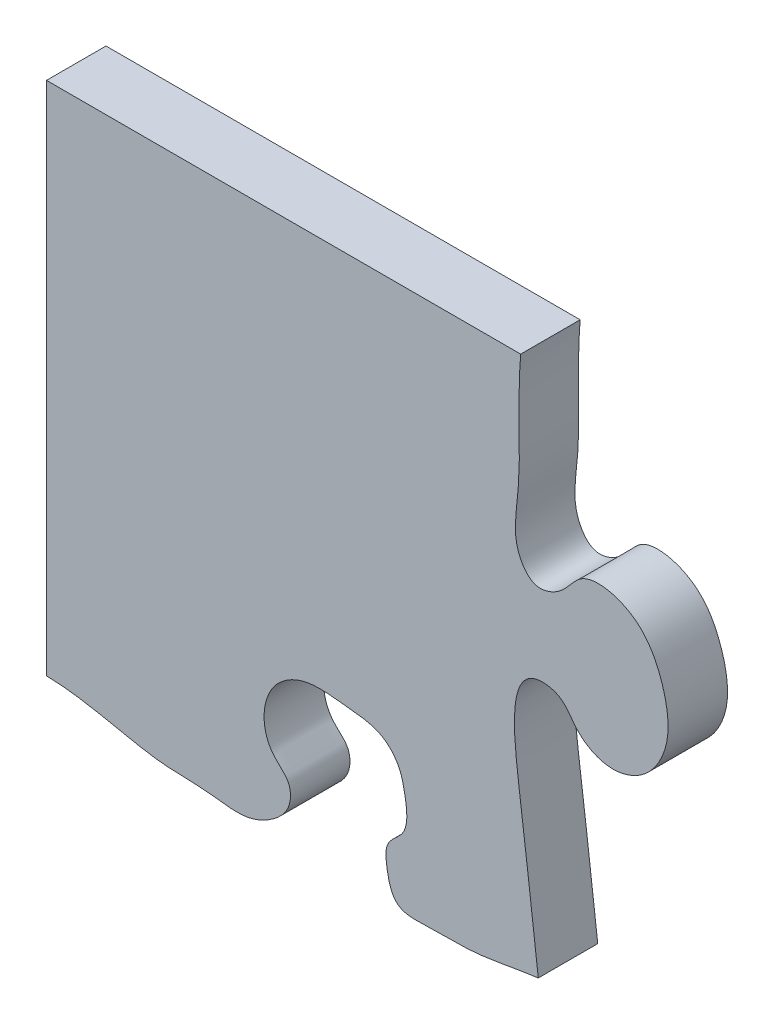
ISO-10303-21;
HEADER;
FILE_DESCRIPTION(('STEP AP214'),'2;1');
FILE_NAME('part.step','',(''),(''),'','','');
FILE_SCHEMA(('AUTOMOTIVE_DESIGN { 1 0 10303 214 1 1 1 1 }'));
ENDSEC;
DATA;
#1=APPLICATION_CONTEXT('core data for automotive mechanical design processes');
#2=APPLICATION_PROTOCOL_DEFINITION('international standard','automotive_design',2000,#1);
#3=PRODUCT_CONTEXT('',#1,'mechanical');
#4=PRODUCT('Part','Part','',(#3));
#5=PRODUCT_RELATED_PRODUCT_CATEGORY('part','',(#4));
#6=PRODUCT_DEFINITION_FORMATION('','',#4);
#7=PRODUCT_DEFINITION_CONTEXT('part definition',#1,'design');
#8=PRODUCT_DEFINITION('design','',#6,#7);
#9=PRODUCT_DEFINITION_SHAPE('','',#8);
#10=(LENGTH_UNIT() NAMED_UNIT(*) SI_UNIT(.MILLI.,.METRE.));
#11=(NAMED_UNIT(*) PLANE_ANGLE_UNIT() SI_UNIT($,.RADIAN.));
#12=(NAMED_UNIT(*) SI_UNIT($,.STERADIAN.) SOLID_ANGLE_UNIT());
#13=UNCERTAINTY_MEASURE_WITH_UNIT(LENGTH_MEASURE(1.E-05),#10,'distance_accuracy_value','');
#14=(GEOMETRIC_REPRESENTATION_CONTEXT(3) GLOBAL_UNCERTAINTY_ASSIGNED_CONTEXT((#13)) GLOBAL_UNIT_ASSIGNED_CONTEXT((#10,
#11,#12)) REPRESENTATION_CONTEXT('',''));
#15=CARTESIAN_POINT('',(0.,0.,0.));
#16=DIRECTION('',(0.,0.,1.));
#17=DIRECTION('',(1.,0.,0.));
#18=AXIS2_PLACEMENT_3D('',#15,#16,#17);
#19=CARTESIAN_POINT('',(-352.534626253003,356.,-0.00999999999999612));
#20=CARTESIAN_POINT('',(-353.877781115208,341.802611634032,-0.00999999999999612));
#21=CARTESIAN_POINT('',(-351.460483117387,322.567956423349,-0.00999999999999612));
#22=CARTESIAN_POINT('',(-355.747404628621,299.493999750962,-0.00999999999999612));
#23=CARTESIAN_POINT('',(-347.645743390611,289.357079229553,-0.00999999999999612));
#24=CARTESIAN_POINT('',(-337.80105524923,293.322704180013,-0.00999999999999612));
#25=CARTESIAN_POINT('',(-331.763521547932,304.464683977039,-0.00999999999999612));
#26=CARTESIAN_POINT('',(-312.737993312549,300.417040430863,-0.00999999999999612));
#27=CARTESIAN_POINT('',(-304.311514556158,284.867329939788,-0.00999999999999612));
#28=CARTESIAN_POINT('',(-301.362858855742,267.518539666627,-0.00999999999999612));
#29=CARTESIAN_POINT('',(-309.525260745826,253.299800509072,-0.00999999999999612));
#30=CARTESIAN_POINT('',(-323.085028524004,249.130779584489,-0.00999999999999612));
#31=CARTESIAN_POINT('',(-333.558735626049,254.453066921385,-0.00999999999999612));
#32=CARTESIAN_POINT('',(-338.061007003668,263.306234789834,-0.00999999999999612));
#33=CARTESIAN_POINT('',(-357.610347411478,266.663664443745,-0.00999999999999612));
#34=CARTESIAN_POINT('',(-352.91397083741,227.568949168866,-0.00999999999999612));
#35=CARTESIAN_POINT('',(-349.689076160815,203.209436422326,-0.00999999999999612));
#36=CARTESIAN_POINT('',(-346.386977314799,175.800103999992,-0.00999999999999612));
#37=CARTESIAN_POINT('',(-343.691373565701,150.269708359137,-0.00999999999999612));
#38=CARTESIAN_POINT('',(-342.931567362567,128.594211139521,-0.00999999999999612));
#39=CARTESIAN_POINT('',(-343.655360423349,107.633085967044,-0.00999999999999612));
#40=CARTESIAN_POINT('',(-357.389603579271,103.824438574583,-0.00999999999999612));
#41=CARTESIAN_POINT('',(-367.576419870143,106.015828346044,-0.00999999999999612));
#42=CARTESIAN_POINT('',(-371.765750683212,114.589953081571,-0.00999999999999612));
#43=CARTESIAN_POINT('',(-382.535012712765,116.182843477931,-0.00999999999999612));
#44=CARTESIAN_POINT('',(-394.783984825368,115.916744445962,-0.00999999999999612));
#45=CARTESIAN_POINT('',(-402.322369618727,104.396558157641,-0.00999999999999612));
#46=CARTESIAN_POINT('',(-405.688784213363,89.1486295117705,-0.00999999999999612));
#47=CARTESIAN_POINT('',(-402.964002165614,71.2455616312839,-0.00999999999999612));
#48=CARTESIAN_POINT('',(-389.022909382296,60.8761001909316,-0.00999999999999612));
#49=CARTESIAN_POINT('',(-377.013010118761,63.0649709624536,-0.00999999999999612));
#50=CARTESIAN_POINT('',(-370.136212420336,70.9200889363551,-0.00999999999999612));
#51=CARTESIAN_POINT('',(-359.248489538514,74.3793713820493,-0.00999999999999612));
#52=CARTESIAN_POINT('',(-347.964757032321,70.4189230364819,-0.00999999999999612));
#53=CARTESIAN_POINT('',(-342.961480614,58.8762689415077,-0.00999999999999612));
#54=CARTESIAN_POINT('',(-344.957853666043,42.6141567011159,-0.00999999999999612));
#55=CARTESIAN_POINT('',(-348.090347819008,20.9428011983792,-0.00999999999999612));
#56=CARTESIAN_POINT('',(-348.787112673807,-1.92187291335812,-0.00999999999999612));
#57=CARTESIAN_POINT('',(-347.063507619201,-23.1354473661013,-0.00999999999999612));
#58=CARTESIAN_POINT('',(-345.803834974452,-40.1989543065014,-0.00999999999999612));
#59=CARTESIAN_POINT('',(-346.365109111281,-52.5147126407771,-0.00999999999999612));
#60=CARTESIAN_POINT('',(-346.987719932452,-61.0081322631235,-0.00999999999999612));
#61=CARTESIAN_POINT('',(-354.605588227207,-67.8105997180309,-0.00999999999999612));
#62=CARTESIAN_POINT('',(-368.483652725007,-69.9483525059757,-0.00999999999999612));
#63=CARTESIAN_POINT('',(-374.929468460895,-56.6181815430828,-0.00999999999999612));
#64=CARTESIAN_POINT('',(-389.51528778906,-54.9578642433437,-0.00999999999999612));
#65=CARTESIAN_POINT('',(-403.927113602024,-62.7741481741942,-0.00999999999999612));
#66=CARTESIAN_POINT('',(-408.906740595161,-79.6272624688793,-0.00999999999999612));
#67=CARTESIAN_POINT('',(-407.354009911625,-95.181625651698,-0.00999999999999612));
#68=CARTESIAN_POINT('',(-399.108136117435,-108.127376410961,-0.00999999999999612));
#69=CARTESIAN_POINT('',(-382.721304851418,-112.332091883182,-0.00999999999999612));
#70=CARTESIAN_POINT('',(-372.627066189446,-99.6029758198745,-0.00999999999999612));
#71=CARTESIAN_POINT('',(-359.245942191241,-98.6507630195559,-0.00999999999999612));
#72=CARTESIAN_POINT('',(-346.811479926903,-105.357996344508,-0.00999999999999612));
#73=CARTESIAN_POINT('',(-347.06309899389,-122.824759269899,-0.00999999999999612));
#74=CARTESIAN_POINT('',(-349.512128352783,-142.867981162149,-0.00999999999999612));
#75=CARTESIAN_POINT('',(-351.967561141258,-164.813498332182,-0.00999999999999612));
#76=CARTESIAN_POINT('',(-354.173348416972,-189.531702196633,-0.00999999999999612));
#77=CARTESIAN_POINT('',(-353.048503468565,-212.668893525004,-0.00999999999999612));
#78=CARTESIAN_POINT('',(-354.739062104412,-232.840407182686,-0.00999999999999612));
#79=CARTESIAN_POINT('',(-344.245211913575,-244.921596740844,-0.00999999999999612));
#80=CARTESIAN_POINT('',(-336.376475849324,-237.735778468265,-0.00999999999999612));
#81=CARTESIAN_POINT('',(-333.938993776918,-228.321764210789,-0.00999999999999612));
#82=CARTESIAN_POINT('',(-321.423877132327,-226.689197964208,-0.00999999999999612));
#83=CARTESIAN_POINT('',(-310.83224361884,-232.911014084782,-0.00999999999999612));
#84=CARTESIAN_POINT('',(-302.540379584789,-246.611975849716,-0.00999999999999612));
#85=CARTESIAN_POINT('',(-304.049270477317,-262.348985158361,-0.00999999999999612));
#86=CARTESIAN_POINT('',(-307.19247660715,-276.895908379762,-0.00999999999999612));
#87=CARTESIAN_POINT('',(-317.916754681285,-281.774853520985,-0.00999999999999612));
#88=CARTESIAN_POINT('',(-328.48323529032,-282.130896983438,-0.00999999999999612));
#89=CARTESIAN_POINT('',(-335.177873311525,-274.391757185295,-0.00999999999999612));
#90=CARTESIAN_POINT('',(-340.967044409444,-267.020526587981,-0.00999999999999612));
#91=CARTESIAN_POINT('',(-352.493784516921,-268.657509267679,-0.00999999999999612));
#92=CARTESIAN_POINT('',(-357.686319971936,-282.822093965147,-0.00999999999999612));
#93=CARTESIAN_POINT('',(-357.597756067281,-311.53856504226,-0.00999999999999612));
#94=CARTESIAN_POINT('',(-355.656952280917,-337.76537977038,-0.00999999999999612));
#95=CARTESIAN_POINT('',(-354.035135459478,-356.,-0.00999999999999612));
#96=B_SPLINE_CURVE_WITH_KNOTS('',3,(#19,#20,#21,#22,#23,#24,#25,#26,#27,#28,#29,#30,#31,#32,#33,
#34,#35,#36,#37,#38,#39,#40,#41,#42,#43,#44,#45,#46,#47,#48,#49,#50,#51,#52,#53,#54,#55,#56,#57,
#58,#59,#60,#61,#62,#63,#64,#65,#66,#67,#68,#69,#70,#71,#72,#73,#74,#75,#76,#77,#78,#79,#80,#81,
#82,#83,#84,#85,#86,#87,#88,#89,#90,#91,#92,#93,#94,#95),.UNSPECIFIED.,.F.,.F.,(4,1,1,1,1,1,1,1,
1,1,1,1,1,1,1,1,1,1,1,1,1,1,1,1,1,1,1,1,1,1,1,1,1,1,1,1,1,1,1,1,1,1,1,1,1,1,1,1,1,1,1,1,1,1,1,1,
1,1,1,1,1,1,1,1,1,1,1,1,1,1,1,1,1,1,4),(0.,0.0362663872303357,0.0516957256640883,
0.0575126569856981,0.0656061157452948,0.0738542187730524,0.0886191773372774,0.103761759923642,
0.118344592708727,0.132658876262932,0.141706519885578,0.152628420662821,0.159936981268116,
0.166346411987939,0.196099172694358,0.222591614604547,0.242329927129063,0.265519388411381,
0.28892287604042,0.3014399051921,0.313339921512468,0.3200215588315,0.327007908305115,
0.335496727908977,0.346341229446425,0.356695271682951,0.367736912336,0.387395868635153,
0.399447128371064,0.408443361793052,0.416078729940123,0.425886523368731,0.4364139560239,
0.44355209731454,0.456701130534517,0.478081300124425,0.500737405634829,0.515722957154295,
0.53328305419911,0.545176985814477,0.547408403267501,0.555597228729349,0.568417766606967,
0.576959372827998,0.589646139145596,0.601337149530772,0.617107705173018,0.631663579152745,
0.64088779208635,0.655943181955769,0.666193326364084,0.679689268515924,0.687162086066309,
0.700019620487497,0.719317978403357,0.742088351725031,0.756487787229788,0.783860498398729,
0.801622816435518,0.8097052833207,0.815461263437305,0.824516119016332,0.833497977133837,
0.842909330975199,0.85562007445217,0.872330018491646,0.883598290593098,0.890881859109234,
0.901363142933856,0.908021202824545,0.916645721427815,0.924017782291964,0.933106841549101,
0.95201687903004,1.),.UNSPECIFIED.);
#97=DIRECTION('',(0.,0.,1.));
#98=VECTOR('',#97,1.);
#99=SURFACE_OF_LINEAR_EXTRUSION('',#96,#98);
#100=DIRECTION('',(0.,0.,1.));
#101=VECTOR('',#100,1.);
#102=CARTESIAN_POINT('',(-346.614016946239,177.25293926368,-0.00999999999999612));
#103=LINE('',#102,#101);
#104=CARTESIAN_POINT('',(-346.614016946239,177.25293926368,0.));
#105=VERTEX_POINT('',#104);
#106=CARTESIAN_POINT('',(-346.614016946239,177.25293926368,20.));
#107=VERTEX_POINT('',#106);
#108=EDGE_CURVE('E87',#105,#107,#103,.T.);
#109=ORIENTED_EDGE('',*,*,#108,.F.);
#110=CARTESIAN_POINT('',(-352.534626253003,356.,0.));
#111=CARTESIAN_POINT('',(-353.877781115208,341.802611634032,0.));
#112=CARTESIAN_POINT('',(-351.460483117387,322.567956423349,0.));
#113=CARTESIAN_POINT('',(-355.747404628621,299.493999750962,0.));
#114=CARTESIAN_POINT('',(-347.645743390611,289.357079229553,0.));
#115=CARTESIAN_POINT('',(-337.80105524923,293.322704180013,0.));
#116=CARTESIAN_POINT('',(-331.763521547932,304.464683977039,0.));
#117=CARTESIAN_POINT('',(-312.737993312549,300.417040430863,0.));
#118=CARTESIAN_POINT('',(-304.311514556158,284.867329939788,0.));
#119=CARTESIAN_POINT('',(-301.362858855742,267.518539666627,0.));
#120=CARTESIAN_POINT('',(-309.525260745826,253.299800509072,0.));
#121=CARTESIAN_POINT('',(-323.085028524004,249.130779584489,0.));
#122=CARTESIAN_POINT('',(-333.558735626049,254.453066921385,0.));
#123=CARTESIAN_POINT('',(-338.061007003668,263.306234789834,0.));
#124=CARTESIAN_POINT('',(-357.610347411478,266.663664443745,0.));
#125=CARTESIAN_POINT('',(-352.91397083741,227.568949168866,0.));
#126=CARTESIAN_POINT('',(-349.689076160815,203.209436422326,0.));
#127=CARTESIAN_POINT('',(-346.386977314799,175.800103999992,0.));
#128=CARTESIAN_POINT('',(-343.691373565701,150.269708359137,0.));
#129=CARTESIAN_POINT('',(-342.931567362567,128.594211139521,0.));
#130=CARTESIAN_POINT('',(-343.655360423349,107.633085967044,0.));
#131=CARTESIAN_POINT('',(-357.389603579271,103.824438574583,0.));
#132=CARTESIAN_POINT('',(-367.576419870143,106.015828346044,0.));
#133=CARTESIAN_POINT('',(-371.765750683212,114.589953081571,0.));
#134=CARTESIAN_POINT('',(-382.535012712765,116.182843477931,0.));
#135=CARTESIAN_POINT('',(-394.783984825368,115.916744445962,0.));
#136=CARTESIAN_POINT('',(-402.322369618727,104.396558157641,0.));
#137=CARTESIAN_POINT('',(-405.688784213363,89.1486295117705,0.));
#138=CARTESIAN_POINT('',(-402.964002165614,71.2455616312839,0.));
#139=CARTESIAN_POINT('',(-389.022909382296,60.8761001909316,0.));
#140=CARTESIAN_POINT('',(-377.013010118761,63.0649709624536,0.));
#141=CARTESIAN_POINT('',(-370.136212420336,70.9200889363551,0.));
#142=CARTESIAN_POINT('',(-359.248489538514,74.3793713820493,0.));
#143=CARTESIAN_POINT('',(-347.964757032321,70.4189230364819,0.));
#144=CARTESIAN_POINT('',(-342.961480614,58.8762689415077,0.));
#145=CARTESIAN_POINT('',(-344.957853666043,42.6141567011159,0.));
#146=CARTESIAN_POINT('',(-348.090347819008,20.9428011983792,0.));
#147=CARTESIAN_POINT('',(-348.787112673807,-1.92187291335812,0.));
#148=CARTESIAN_POINT('',(-347.063507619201,-23.1354473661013,0.));
#149=CARTESIAN_POINT('',(-345.803834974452,-40.1989543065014,0.));
#150=CARTESIAN_POINT('',(-346.365109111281,-52.5147126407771,0.));
#151=CARTESIAN_POINT('',(-346.987719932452,-61.0081322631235,0.));
#152=CARTESIAN_POINT('',(-354.605588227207,-67.8105997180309,0.));
#153=CARTESIAN_POINT('',(-368.483652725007,-69.9483525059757,0.));
#154=CARTESIAN_POINT('',(-374.929468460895,-56.6181815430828,0.));
#155=CARTESIAN_POINT('',(-389.51528778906,-54.9578642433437,0.));
#156=CARTESIAN_POINT('',(-403.927113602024,-62.7741481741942,0.));
#157=CARTESIAN_POINT('',(-408.906740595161,-79.6272624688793,0.));
#158=CARTESIAN_POINT('',(-407.354009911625,-95.181625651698,0.));
#159=CARTESIAN_POINT('',(-399.108136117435,-108.127376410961,0.));
#160=CARTESIAN_POINT('',(-382.721304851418,-112.332091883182,0.));
#161=CARTESIAN_POINT('',(-372.627066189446,-99.6029758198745,0.));
#162=CARTESIAN_POINT('',(-359.245942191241,-98.6507630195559,0.));
#163=CARTESIAN_POINT('',(-346.811479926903,-105.357996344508,0.));
#164=CARTESIAN_POINT('',(-347.06309899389,-122.824759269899,0.));
#165=CARTESIAN_POINT('',(-349.512128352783,-142.867981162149,0.));
#166=CARTESIAN_POINT('',(-351.967561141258,-164.813498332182,0.));
#167=CARTESIAN_POINT('',(-354.173348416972,-189.531702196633,0.));
#168=CARTESIAN_POINT('',(-353.048503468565,-212.668893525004,0.));
#169=CARTESIAN_POINT('',(-354.739062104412,-232.840407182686,0.));
#170=CARTESIAN_POINT('',(-344.245211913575,-244.921596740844,0.));
#171=CARTESIAN_POINT('',(-336.376475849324,-237.735778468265,0.));
#172=CARTESIAN_POINT('',(-333.938993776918,-228.321764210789,0.));
#173=CARTESIAN_POINT('',(-321.423877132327,-226.689197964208,0.));
#174=CARTESIAN_POINT('',(-310.83224361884,-232.911014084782,0.));
#175=CARTESIAN_POINT('',(-302.540379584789,-246.611975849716,0.));
#176=CARTESIAN_POINT('',(-304.049270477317,-262.348985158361,0.));
#177=CARTESIAN_POINT('',(-307.19247660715,-276.895908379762,0.));
#178=CARTESIAN_POINT('',(-317.916754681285,-281.774853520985,0.));
#179=CARTESIAN_POINT('',(-328.48323529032,-282.130896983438,0.));
#180=CARTESIAN_POINT('',(-335.177873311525,-274.391757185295,0.));
#181=CARTESIAN_POINT('',(-340.967044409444,-267.020526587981,0.));
#182=CARTESIAN_POINT('',(-352.493784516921,-268.657509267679,0.));
#183=CARTESIAN_POINT('',(-357.686319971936,-282.822093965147,0.));
#184=CARTESIAN_POINT('',(-357.597756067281,-311.53856504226,0.));
#185=CARTESIAN_POINT('',(-355.656952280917,-337.76537977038,0.));
#186=CARTESIAN_POINT('',(-354.035135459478,-356.,0.));
#187=B_SPLINE_CURVE_WITH_KNOTS('',3,(#110,#111,#112,#113,#114,#115,#116,#117,#118,#119,#120,
#121,#122,#123,#124,#125,#126,#127,#128,#129,#130,#131,#132,#133,#134,#135,#136,#137,#138,#139,
#140,#141,#142,#143,#144,#145,#146,#147,#148,#149,#150,#151,#152,#153,#154,#155,#156,#157,#158,
#159,#160,#161,#162,#163,#164,#165,#166,#167,#168,#169,#170,#171,#172,#173,#174,#175,#176,#177,
#178,#179,#180,#181,#182,#183,#184,#185,#186),.UNSPECIFIED.,.F.,.F.,(4,1,1,1,1,1,1,1,1,1,1,1,1,
1,1,1,1,1,1,1,1,1,1,1,1,1,1,1,1,1,1,1,1,1,1,1,1,1,1,1,1,1,1,1,1,1,1,1,1,1,1,1,1,1,1,1,1,1,1,1,1,
1,1,1,1,1,1,1,1,1,1,1,1,1,4),(0.,0.0362663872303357,0.0516957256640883,0.0575126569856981,
0.0656061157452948,0.0738542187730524,0.0886191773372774,0.103761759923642,0.118344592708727,
0.132658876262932,0.141706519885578,0.152628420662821,0.159936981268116,0.166346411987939,
0.196099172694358,0.222591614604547,0.242329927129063,0.265519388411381,0.28892287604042,
0.3014399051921,0.313339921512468,0.3200215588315,0.327007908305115,0.335496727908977,
0.346341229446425,0.356695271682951,0.367736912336,0.387395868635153,0.399447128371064,
0.408443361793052,0.416078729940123,0.425886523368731,0.4364139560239,0.44355209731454,
0.456701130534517,0.478081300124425,0.500737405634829,0.515722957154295,0.53328305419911,
0.545176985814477,0.547408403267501,0.555597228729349,0.568417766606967,0.576959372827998,
0.589646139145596,0.601337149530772,0.617107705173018,0.631663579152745,0.64088779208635,
0.655943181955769,0.666193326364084,0.679689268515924,0.687162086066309,0.700019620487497,
0.719317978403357,0.742088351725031,0.756487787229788,0.783860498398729,0.801622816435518,
0.8097052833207,0.815461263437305,0.824516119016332,0.833497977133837,0.842909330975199,
0.85562007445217,0.872330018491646,0.883598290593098,0.890881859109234,0.901363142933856,
0.908021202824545,0.916645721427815,0.924017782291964,0.933106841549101,0.95201687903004,1.),.UNSPECIFIED.);
#188=CARTESIAN_POINT('',(-352.534626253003,356.,0.));
#189=VERTEX_POINT('',#188);
#190=EDGE_CURVE('E38',#189,#105,#187,.T.);
#191=ORIENTED_EDGE('',*,*,#190,.F.);
#192=DIRECTION('',(0.,0.,1.));
#193=VECTOR('',#192,1.);
#194=CARTESIAN_POINT('',(-352.534626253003,356.,-0.00999999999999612));
#195=LINE('',#194,#193);
#196=CARTESIAN_POINT('',(-352.534626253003,356.,20.));
#197=VERTEX_POINT('',#196);
#198=EDGE_CURVE('E44',#197,#189,#195,.F.);
#199=ORIENTED_EDGE('',*,*,#198,.F.);
#200=CARTESIAN_POINT('',(-352.534626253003,356.,20.));
#201=CARTESIAN_POINT('',(-353.877781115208,341.802611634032,20.));
#202=CARTESIAN_POINT('',(-351.460483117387,322.567956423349,20.));
#203=CARTESIAN_POINT('',(-355.747404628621,299.493999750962,20.));
#204=CARTESIAN_POINT('',(-347.645743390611,289.357079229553,20.));
#205=CARTESIAN_POINT('',(-337.80105524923,293.322704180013,20.));
#206=CARTESIAN_POINT('',(-331.763521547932,304.464683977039,20.));
#207=CARTESIAN_POINT('',(-312.737993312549,300.417040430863,20.));
#208=CARTESIAN_POINT('',(-304.311514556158,284.867329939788,20.));
#209=CARTESIAN_POINT('',(-301.362858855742,267.518539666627,20.));
#210=CARTESIAN_POINT('',(-309.525260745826,253.299800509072,20.));
#211=CARTESIAN_POINT('',(-323.085028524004,249.130779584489,20.));
#212=CARTESIAN_POINT('',(-333.558735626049,254.453066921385,20.));
#213=CARTESIAN_POINT('',(-338.061007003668,263.306234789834,20.));
#214=CARTESIAN_POINT('',(-357.610347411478,266.663664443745,20.));
#215=CARTESIAN_POINT('',(-352.91397083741,227.568949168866,20.));
#216=CARTESIAN_POINT('',(-349.689076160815,203.209436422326,20.));
#217=CARTESIAN_POINT('',(-346.386977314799,175.800103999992,20.));
#218=CARTESIAN_POINT('',(-343.691373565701,150.269708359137,20.));
#219=CARTESIAN_POINT('',(-342.931567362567,128.594211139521,20.));
#220=CARTESIAN_POINT('',(-343.655360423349,107.633085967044,20.));
#221=CARTESIAN_POINT('',(-357.389603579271,103.824438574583,20.));
#222=CARTESIAN_POINT('',(-367.576419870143,106.015828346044,20.));
#223=CARTESIAN_POINT('',(-371.765750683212,114.589953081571,20.));
#224=CARTESIAN_POINT('',(-382.535012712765,116.182843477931,20.));
#225=CARTESIAN_POINT('',(-394.783984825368,115.916744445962,20.));
#226=CARTESIAN_POINT('',(-402.322369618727,104.396558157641,20.));
#227=CARTESIAN_POINT('',(-405.688784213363,89.1486295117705,20.));
#228=CARTESIAN_POINT('',(-402.964002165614,71.2455616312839,20.));
#229=CARTESIAN_POINT('',(-389.022909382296,60.8761001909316,20.));
#230=CARTESIAN_POINT('',(-377.013010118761,63.0649709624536,20.));
#231=CARTESIAN_POINT('',(-370.136212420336,70.9200889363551,20.));
#232=CARTESIAN_POINT('',(-359.248489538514,74.3793713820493,20.));
#233=CARTESIAN_POINT('',(-347.964757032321,70.4189230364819,20.));
#234=CARTESIAN_POINT('',(-342.961480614,58.8762689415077,20.));
#235=CARTESIAN_POINT('',(-344.957853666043,42.6141567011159,20.));
#236=CARTESIAN_POINT('',(-348.090347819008,20.9428011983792,20.));
#237=CARTESIAN_POINT('',(-348.787112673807,-1.92187291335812,20.));
#238=CARTESIAN_POINT('',(-347.063507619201,-23.1354473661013,20.));
#239=CARTESIAN_POINT('',(-345.803834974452,-40.1989543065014,20.));
#240=CARTESIAN_POINT('',(-346.365109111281,-52.5147126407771,20.));
#241=CARTESIAN_POINT('',(-346.987719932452,-61.0081322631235,20.));
#242=CARTESIAN_POINT('',(-354.605588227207,-67.8105997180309,20.));
#243=CARTESIAN_POINT('',(-368.483652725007,-69.9483525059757,20.));
#244=CARTESIAN_POINT('',(-374.929468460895,-56.6181815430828,20.));
#245=CARTESIAN_POINT('',(-389.51528778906,-54.9578642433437,20.));
#246=CARTESIAN_POINT('',(-403.927113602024,-62.7741481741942,20.));
#247=CARTESIAN_POINT('',(-408.906740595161,-79.6272624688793,20.));
#248=CARTESIAN_POINT('',(-407.354009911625,-95.181625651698,20.));
#249=CARTESIAN_POINT('',(-399.108136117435,-108.127376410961,20.));
#250=CARTESIAN_POINT('',(-382.721304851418,-112.332091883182,20.));
#251=CARTESIAN_POINT('',(-372.627066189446,-99.6029758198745,20.));
#252=CARTESIAN_POINT('',(-359.245942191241,-98.6507630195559,20.));
#253=CARTESIAN_POINT('',(-346.811479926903,-105.357996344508,20.));
#254=CARTESIAN_POINT('',(-347.06309899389,-122.824759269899,20.));
#255=CARTESIAN_POINT('',(-349.512128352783,-142.867981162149,20.));
#256=CARTESIAN_POINT('',(-351.967561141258,-164.813498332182,20.));
#257=CARTESIAN_POINT('',(-354.173348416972,-189.531702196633,20.));
#258=CARTESIAN_POINT('',(-353.048503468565,-212.668893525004,20.));
#259=CARTESIAN_POINT('',(-354.739062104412,-232.840407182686,20.));
#260=CARTESIAN_POINT('',(-344.245211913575,-244.921596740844,20.));
#261=CARTESIAN_POINT('',(-336.376475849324,-237.735778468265,20.));
#262=CARTESIAN_POINT('',(-333.938993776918,-228.321764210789,20.));
#263=CARTESIAN_POINT('',(-321.423877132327,-226.689197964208,20.));
#264=CARTESIAN_POINT('',(-310.83224361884,-232.911014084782,20.));
#265=CARTESIAN_POINT('',(-302.540379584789,-246.611975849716,20.));
#266=CARTESIAN_POINT('',(-304.049270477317,-262.348985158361,20.));
#267=CARTESIAN_POINT('',(-307.19247660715,-276.895908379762,20.));
#268=CARTESIAN_POINT('',(-317.916754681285,-281.774853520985,20.));
#269=CARTESIAN_POINT('',(-328.48323529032,-282.130896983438,20.));
#270=CARTESIAN_POINT('',(-335.177873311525,-274.391757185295,20.));
#271=CARTESIAN_POINT('',(-340.967044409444,-267.020526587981,20.));
#272=CARTESIAN_POINT('',(-352.493784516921,-268.657509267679,20.));
#273=CARTESIAN_POINT('',(-357.686319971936,-282.822093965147,20.));
#274=CARTESIAN_POINT('',(-357.597756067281,-311.53856504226,20.));
#275=CARTESIAN_POINT('',(-355.656952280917,-337.76537977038,20.));
#276=CARTESIAN_POINT('',(-354.035135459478,-356.,20.));
#277=B_SPLINE_CURVE_WITH_KNOTS('',3,(#200,#201,#202,#203,#204,#205,#206,#207,#208,#209,#210,
#211,#212,#213,#214,#215,#216,#217,#218,#219,#220,#221,#222,#223,#224,#225,#226,#227,#228,#229,
#230,#231,#232,#233,#234,#235,#236,#237,#238,#239,#240,#241,#242,#243,#244,#245,#246,#247,#248,
#249,#250,#251,#252,#253,#254,#255,#256,#257,#258,#259,#260,#261,#262,#263,#264,#265,#266,#267,
#268,#269,#270,#271,#272,#273,#274,#275,#276),.UNSPECIFIED.,.F.,.F.,(4,1,1,1,1,1,1,1,1,1,1,1,1,
1,1,1,1,1,1,1,1,1,1,1,1,1,1,1,1,1,1,1,1,1,1,1,1,1,1,1,1,1,1,1,1,1,1,1,1,1,1,1,1,1,1,1,1,1,1,1,1,
1,1,1,1,1,1,1,1,1,1,1,1,1,4),(0.,0.0362663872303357,0.0516957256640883,0.0575126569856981,
0.0656061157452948,0.0738542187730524,0.0886191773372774,0.103761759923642,0.118344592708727,
0.132658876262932,0.141706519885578,0.152628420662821,0.159936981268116,0.166346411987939,
0.196099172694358,0.222591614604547,0.242329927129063,0.265519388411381,0.28892287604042,
0.3014399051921,0.313339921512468,0.3200215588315,0.327007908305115,0.335496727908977,
0.346341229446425,0.356695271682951,0.367736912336,0.387395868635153,0.399447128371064,
0.408443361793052,0.416078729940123,0.425886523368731,0.4364139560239,0.44355209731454,
0.456701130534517,0.478081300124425,0.500737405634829,0.515722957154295,0.53328305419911,
0.545176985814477,0.547408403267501,0.555597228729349,0.568417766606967,0.576959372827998,
0.589646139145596,0.601337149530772,0.617107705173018,0.631663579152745,0.64088779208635,
0.655943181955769,0.666193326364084,0.679689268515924,0.687162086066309,0.700019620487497,
0.719317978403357,0.742088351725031,0.756487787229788,0.783860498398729,0.801622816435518,
0.8097052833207,0.815461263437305,0.824516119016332,0.833497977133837,0.842909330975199,
0.85562007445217,0.872330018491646,0.883598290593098,0.890881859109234,0.901363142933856,
0.908021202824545,0.916645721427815,0.924017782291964,0.933106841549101,0.95201687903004,1.),.UNSPECIFIED.);
#278=EDGE_CURVE('E11',#197,#107,#277,.T.);
#279=ORIENTED_EDGE('',*,*,#278,.T.);
#280=EDGE_LOOP('',(#109,#191,#199,#279));
#281=FACE_BOUND('',#280,.T.);
#282=ADVANCED_FACE('F34',(#281),#99,.F.);
#283=CARTESIAN_POINT('',(-512.,182.54718893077,-0.00999999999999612));
#284=CARTESIAN_POINT('',(-502.994579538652,182.412705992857,-0.00999999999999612));
#285=CARTESIAN_POINT('',(-490.032252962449,179.483922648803,-0.00999999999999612));
#286=CARTESIAN_POINT('',(-471.955399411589,175.969991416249,-0.00999999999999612));
#287=CARTESIAN_POINT('',(-458.293816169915,176.407484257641,-0.00999999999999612));
#288=CARTESIAN_POINT('',(-445.56380036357,173.774845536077,-0.00999999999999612));
#289=CARTESIAN_POINT('',(-435.979338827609,178.264104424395,-0.00999999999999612));
#290=CARTESIAN_POINT('',(-429.893467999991,184.172588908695,-0.00999999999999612));
#291=CARTESIAN_POINT('',(-429.558480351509,192.942663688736,-0.00999999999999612));
#292=CARTESIAN_POINT('',(-436.734523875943,197.513062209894,-0.00999999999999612));
#293=CARTESIAN_POINT('',(-440.013304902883,207.37990412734,-0.00999999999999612));
#294=CARTESIAN_POINT('',(-436.620305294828,218.795290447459,-0.00999999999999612));
#295=CARTESIAN_POINT('',(-424.680250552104,225.919430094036,-0.00999999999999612));
#296=CARTESIAN_POINT('',(-411.901917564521,223.977194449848,-0.00999999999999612));
#297=CARTESIAN_POINT('',(-399.663909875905,223.173841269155,-0.00999999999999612));
#298=CARTESIAN_POINT('',(-393.048398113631,215.753844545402,-0.00999999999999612));
#299=CARTESIAN_POINT('',(-391.122239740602,207.108781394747,-0.00999999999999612));
#300=CARTESIAN_POINT('',(-389.789199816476,197.036802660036,-0.00999999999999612));
#301=CARTESIAN_POINT('',(-398.37475560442,191.784345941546,-0.00999999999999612));
#302=CARTESIAN_POINT('',(-397.652006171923,183.198912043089,-0.00999999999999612));
#303=CARTESIAN_POINT('',(-395.108426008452,172.857587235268,-0.00999999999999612));
#304=CARTESIAN_POINT('',(-381.593558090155,173.918582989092,-0.00999999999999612));
#305=CARTESIAN_POINT('',(-366.641883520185,173.326491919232,-0.00999999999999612));
#306=CARTESIAN_POINT('',(-353.981695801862,176.349283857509,-0.00999999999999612));
#307=CARTESIAN_POINT('',(-346.614016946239,177.25293926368,-0.00999999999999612));
#308=B_SPLINE_CURVE_WITH_KNOTS('',3,(#283,#284,#285,#286,#287,#288,#289,#290,#291,#292,#293,
#294,#295,#296,#297,#298,#299,#300,#301,#302,#303,#304,#305,#306,#307),.UNSPECIFIED.,.F.,.F.,(4,
1,1,1,1,1,1,1,1,1,1,1,1,1,1,1,1,1,1,1,1,1,4),(0.,0.104103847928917,0.153900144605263,
0.212653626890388,0.263123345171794,0.299098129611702,0.331105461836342,0.35735016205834,
0.387518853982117,0.421345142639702,0.47158565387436,0.512680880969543,0.570698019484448,
0.618413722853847,0.648743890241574,0.677248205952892,0.72332915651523,0.749747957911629,
0.779169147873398,0.816184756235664,0.856147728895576,0.912133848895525,1.),.UNSPECIFIED.);
#309=DIRECTION('',(0.,0.,1.));
#310=VECTOR('',#309,1.);
#311=SURFACE_OF_LINEAR_EXTRUSION('',#308,#310);
#312=DIRECTION('',(0.,0.,1.));
#313=VECTOR('',#312,1.);
#314=CARTESIAN_POINT('',(-512.,182.54718893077,-0.00999999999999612));
#315=LINE('',#314,#313);
#316=CARTESIAN_POINT('',(-512.,182.54718893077,20.));
#317=VERTEX_POINT('',#316);
#318=CARTESIAN_POINT('',(-512.,182.54718893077,0.));
#319=VERTEX_POINT('',#318);
#320=EDGE_CURVE('E80',#317,#319,#315,.F.);
#321=ORIENTED_EDGE('',*,*,#320,.T.);
#322=CARTESIAN_POINT('',(-512.,182.54718893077,0.));
#323=CARTESIAN_POINT('',(-502.994579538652,182.412705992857,0.));
#324=CARTESIAN_POINT('',(-490.032252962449,179.483922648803,0.));
#325=CARTESIAN_POINT('',(-471.955399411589,175.969991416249,0.));
#326=CARTESIAN_POINT('',(-458.293816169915,176.407484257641,0.));
#327=CARTESIAN_POINT('',(-445.56380036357,173.774845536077,0.));
#328=CARTESIAN_POINT('',(-435.979338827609,178.264104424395,0.));
#329=CARTESIAN_POINT('',(-429.893467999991,184.172588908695,0.));
#330=CARTESIAN_POINT('',(-429.558480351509,192.942663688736,0.));
#331=CARTESIAN_POINT('',(-436.734523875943,197.513062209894,0.));
#332=CARTESIAN_POINT('',(-440.013304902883,207.37990412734,0.));
#333=CARTESIAN_POINT('',(-436.620305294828,218.795290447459,0.));
#334=CARTESIAN_POINT('',(-424.680250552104,225.919430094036,0.));
#335=CARTESIAN_POINT('',(-411.901917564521,223.977194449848,0.));
#336=CARTESIAN_POINT('',(-399.663909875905,223.173841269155,0.));
#337=CARTESIAN_POINT('',(-393.048398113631,215.753844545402,0.));
#338=CARTESIAN_POINT('',(-391.122239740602,207.108781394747,0.));
#339=CARTESIAN_POINT('',(-389.789199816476,197.036802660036,0.));
#340=CARTESIAN_POINT('',(-398.37475560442,191.784345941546,0.));
#341=CARTESIAN_POINT('',(-397.652006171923,183.198912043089,0.));
#342=CARTESIAN_POINT('',(-395.108426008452,172.857587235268,0.));
#343=CARTESIAN_POINT('',(-381.593558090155,173.918582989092,0.));
#344=CARTESIAN_POINT('',(-366.641883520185,173.326491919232,0.));
#345=CARTESIAN_POINT('',(-353.981695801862,176.349283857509,0.));
#346=CARTESIAN_POINT('',(-346.614016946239,177.25293926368,0.));
#347=B_SPLINE_CURVE_WITH_KNOTS('',3,(#322,#323,#324,#325,#326,#327,#328,#329,#330,#331,#332,
#333,#334,#335,#336,#337,#338,#339,#340,#341,#342,#343,#344,#345,#346),.UNSPECIFIED.,.F.,.F.,(4,
1,1,1,1,1,1,1,1,1,1,1,1,1,1,1,1,1,1,1,1,1,4),(0.,0.104103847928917,0.153900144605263,
0.212653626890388,0.263123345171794,0.299098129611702,0.331105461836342,0.35735016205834,
0.387518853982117,0.421345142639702,0.47158565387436,0.512680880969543,0.570698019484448,
0.618413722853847,0.648743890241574,0.677248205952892,0.72332915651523,0.749747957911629,
0.779169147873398,0.816184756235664,0.856147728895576,0.912133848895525,1.),.UNSPECIFIED.);
#348=EDGE_CURVE('E94',#319,#105,#347,.T.);
#349=ORIENTED_EDGE('',*,*,#348,.T.);
#350=ORIENTED_EDGE('',*,*,#108,.T.);
#351=CARTESIAN_POINT('',(-512.,182.54718893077,20.));
#352=CARTESIAN_POINT('',(-502.994579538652,182.412705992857,20.));
#353=CARTESIAN_POINT('',(-490.032252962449,179.483922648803,20.));
#354=CARTESIAN_POINT('',(-471.955399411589,175.969991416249,20.));
#355=CARTESIAN_POINT('',(-458.293816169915,176.407484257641,20.));
#356=CARTESIAN_POINT('',(-445.56380036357,173.774845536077,20.));
#357=CARTESIAN_POINT('',(-435.979338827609,178.264104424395,20.));
#358=CARTESIAN_POINT('',(-429.893467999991,184.172588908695,20.));
#359=CARTESIAN_POINT('',(-429.558480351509,192.942663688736,20.));
#360=CARTESIAN_POINT('',(-436.734523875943,197.513062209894,20.));
#361=CARTESIAN_POINT('',(-440.013304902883,207.37990412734,20.));
#362=CARTESIAN_POINT('',(-436.620305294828,218.795290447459,20.));
#363=CARTESIAN_POINT('',(-424.680250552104,225.919430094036,20.));
#364=CARTESIAN_POINT('',(-411.901917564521,223.977194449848,20.));
#365=CARTESIAN_POINT('',(-399.663909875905,223.173841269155,20.));
#366=CARTESIAN_POINT('',(-393.048398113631,215.753844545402,20.));
#367=CARTESIAN_POINT('',(-391.122239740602,207.108781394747,20.));
#368=CARTESIAN_POINT('',(-389.789199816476,197.036802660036,20.));
#369=CARTESIAN_POINT('',(-398.37475560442,191.784345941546,20.));
#370=CARTESIAN_POINT('',(-397.652006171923,183.198912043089,20.));
#371=CARTESIAN_POINT('',(-395.108426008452,172.857587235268,20.));
#372=CARTESIAN_POINT('',(-381.593558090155,173.918582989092,20.));
#373=CARTESIAN_POINT('',(-366.641883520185,173.326491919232,20.));
#374=CARTESIAN_POINT('',(-353.981695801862,176.349283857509,20.));
#375=CARTESIAN_POINT('',(-346.614016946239,177.25293926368,20.));
#376=B_SPLINE_CURVE_WITH_KNOTS('',3,(#351,#352,#353,#354,#355,#356,#357,#358,#359,#360,#361,
#362,#363,#364,#365,#366,#367,#368,#369,#370,#371,#372,#373,#374,#375),.UNSPECIFIED.,.F.,.F.,(4,
1,1,1,1,1,1,1,1,1,1,1,1,1,1,1,1,1,1,1,1,1,4),(0.,0.104103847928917,0.153900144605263,
0.212653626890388,0.263123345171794,0.299098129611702,0.331105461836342,0.35735016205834,
0.387518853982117,0.421345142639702,0.47158565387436,0.512680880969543,0.570698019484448,
0.618413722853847,0.648743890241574,0.677248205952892,0.72332915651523,0.749747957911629,
0.779169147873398,0.816184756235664,0.856147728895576,0.912133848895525,1.),.UNSPECIFIED.);
#377=EDGE_CURVE('E95',#317,#107,#376,.T.);
#378=ORIENTED_EDGE('',*,*,#377,.F.);
#379=EDGE_LOOP('',(#321,#349,#350,#378));
#380=FACE_BOUND('',#379,.T.);
#381=ADVANCED_FACE('F92',(#380),#311,.T.);
#382=CARTESIAN_POINT('',(512.,356.,20.));
#383=DIRECTION('',(0.,-1.,0.));
#384=DIRECTION('',(1.,0.,0.));
#385=AXIS2_PLACEMENT_3D('',#382,#383,#384);
#386=PLANE('',#385);
#387=DIRECTION('',(-1.,0.,0.));
#388=VECTOR('',#387,1.);
#389=CARTESIAN_POINT('',(512.,356.,20.));
#390=LINE('',#389,#388);
#391=CARTESIAN_POINT('',(-512.,356.,20.));
#392=VERTEX_POINT('',#391);
#393=EDGE_CURVE('E103',#197,#392,#390,.T.);
#394=ORIENTED_EDGE('',*,*,#393,.F.);
#395=ORIENTED_EDGE('',*,*,#198,.T.);
#396=DIRECTION('',(-1.,0.,0.));
#397=VECTOR('',#396,1.);
#398=CARTESIAN_POINT('',(512.,356.,0.));
#399=LINE('',#398,#397);
#400=CARTESIAN_POINT('',(-512.,356.,0.));
#401=VERTEX_POINT('',#400);
#402=EDGE_CURVE('E88',#189,#401,#399,.T.);
#403=ORIENTED_EDGE('',*,*,#402,.T.);
#404=DIRECTION('',(0.,0.,-1.));
#405=VECTOR('',#404,1.);
#406=CARTESIAN_POINT('',(-512.,356.,20.));
#407=LINE('',#406,#405);
#408=EDGE_CURVE('E83',#392,#401,#407,.T.);
#409=ORIENTED_EDGE('',*,*,#408,.F.);
#410=EDGE_LOOP('',(#394,#395,#403,#409));
#411=FACE_BOUND('',#410,.T.);
#412=ADVANCED_FACE('F127',(#411),#386,.F.);
#413=CARTESIAN_POINT('',(-512.,-356.,20.));
#414=DIRECTION('',(1.,0.,0.));
#415=DIRECTION('',(0.,0.,-1.));
#416=AXIS2_PLACEMENT_3D('',#413,#414,#415);
#417=PLANE('',#416);
#418=ORIENTED_EDGE('',*,*,#320,.F.);
#419=DIRECTION('',(0.,-1.,0.));
#420=VECTOR('',#419,1.);
#421=CARTESIAN_POINT('',(-512.,-356.,20.));
#422=LINE('',#421,#420);
#423=EDGE_CURVE('E141',#392,#317,#422,.T.);
#424=ORIENTED_EDGE('',*,*,#423,.F.);
#425=ORIENTED_EDGE('',*,*,#408,.T.);
#426=DIRECTION('',(0.,-1.,0.));
#427=VECTOR('',#426,1.);
#428=CARTESIAN_POINT('',(-512.,-356.,0.));
#429=LINE('',#428,#427);
#430=EDGE_CURVE('E76',#401,#319,#429,.T.);
#431=ORIENTED_EDGE('',*,*,#430,.T.);
#432=EDGE_LOOP('',(#418,#424,#425,#431));
#433=FACE_BOUND('',#432,.T.);
#434=ADVANCED_FACE('F78',(#433),#417,.F.);
#435=CARTESIAN_POINT('',(0.,0.,0.));
#436=DIRECTION('',(0.,0.,1.));
#437=DIRECTION('',(1.,0.,0.));
#438=AXIS2_PLACEMENT_3D('',#435,#436,#437);
#439=PLANE('',#438);
#440=ORIENTED_EDGE('',*,*,#402,.F.);
#441=ORIENTED_EDGE('',*,*,#190,.T.);
#442=ORIENTED_EDGE('',*,*,#348,.F.);
#443=ORIENTED_EDGE('',*,*,#430,.F.);
#444=EDGE_LOOP('',(#440,#441,#442,#443));
#445=FACE_BOUND('',#444,.T.);
#446=ADVANCED_FACE('F97',(#445),#439,.F.);
#447=CARTESIAN_POINT('',(0.,0.,20.));
#448=DIRECTION('',(0.,0.,1.));
#449=DIRECTION('',(1.,0.,0.));
#450=AXIS2_PLACEMENT_3D('',#447,#448,#449);
#451=PLANE('',#450);
#452=ORIENTED_EDGE('',*,*,#278,.F.);
#453=ORIENTED_EDGE('',*,*,#393,.T.);
#454=ORIENTED_EDGE('',*,*,#423,.T.);
#455=ORIENTED_EDGE('',*,*,#377,.T.);
#456=EDGE_LOOP('',(#452,#453,#454,#455));
#457=FACE_BOUND('',#456,.T.);
#458=ADVANCED_FACE('F128',(#457),#451,.T.);
#459=CLOSED_SHELL('',(#282,#381,#412,#434,#446,#458));
#460=MANIFOLD_SOLID_BREP('B2',#459);
#461=ADVANCED_BREP_SHAPE_REPRESENTATION('',(#18,#460),#14);
#462=SHAPE_DEFINITION_REPRESENTATION(#9,#461);
ENDSEC;
END-ISO-10303-21;
